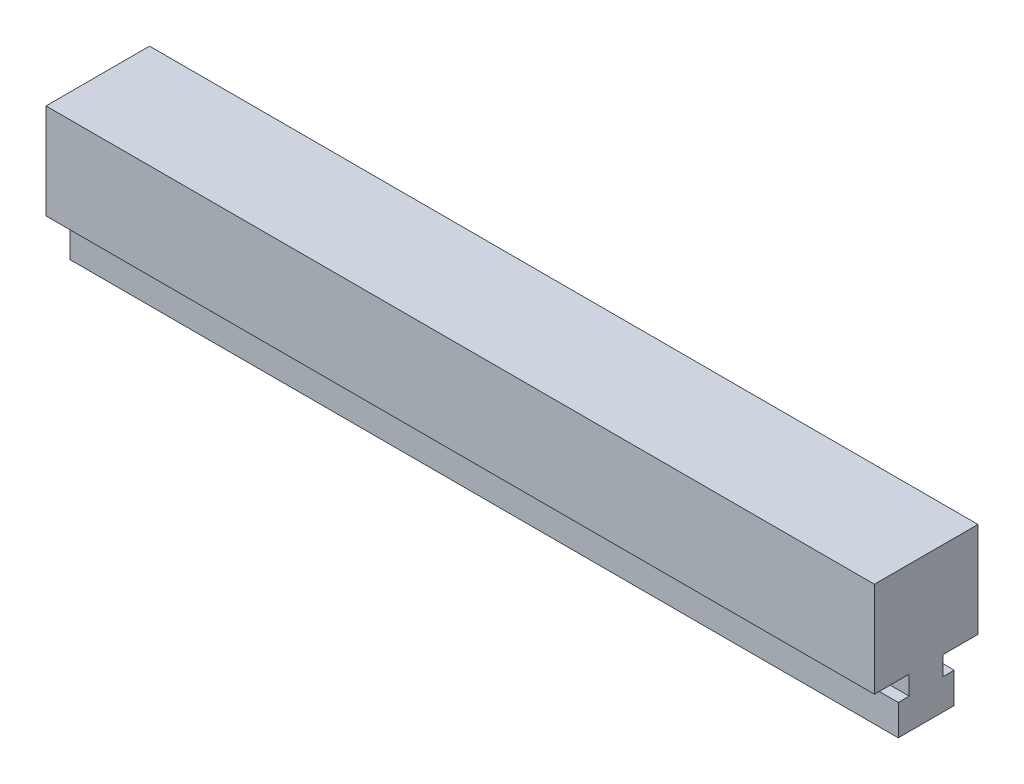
ISO-10303-21;
HEADER;
FILE_DESCRIPTION(('STEP AP214'),'2;1');
FILE_NAME('part.step','',(''),(''),'','','');
FILE_SCHEMA(('AUTOMOTIVE_DESIGN { 1 0 10303 214 1 1 1 1 }'));
ENDSEC;
DATA;
#1=APPLICATION_CONTEXT('core data for automotive mechanical design processes');
#2=APPLICATION_PROTOCOL_DEFINITION('international standard','automotive_design',2000,#1);
#3=PRODUCT_CONTEXT('',#1,'mechanical');
#4=PRODUCT('Part','Part','',(#3));
#5=PRODUCT_RELATED_PRODUCT_CATEGORY('part','',(#4));
#6=PRODUCT_DEFINITION_FORMATION('','',#4);
#7=PRODUCT_DEFINITION_CONTEXT('part definition',#1,'design');
#8=PRODUCT_DEFINITION('design','',#6,#7);
#9=PRODUCT_DEFINITION_SHAPE('','',#8);
#10=(LENGTH_UNIT() NAMED_UNIT(*) SI_UNIT(.MILLI.,.METRE.));
#11=(NAMED_UNIT(*) PLANE_ANGLE_UNIT() SI_UNIT($,.RADIAN.));
#12=(NAMED_UNIT(*) SI_UNIT($,.STERADIAN.) SOLID_ANGLE_UNIT());
#13=UNCERTAINTY_MEASURE_WITH_UNIT(LENGTH_MEASURE(1.E-05),#10,'distance_accuracy_value','');
#14=(GEOMETRIC_REPRESENTATION_CONTEXT(3) GLOBAL_UNCERTAINTY_ASSIGNED_CONTEXT((#13)) GLOBAL_UNIT_ASSIGNED_CONTEXT((#10,
#11,#12)) REPRESENTATION_CONTEXT('',''));
#15=CARTESIAN_POINT('',(0.,0.,0.));
#16=DIRECTION('',(0.,0.,1.));
#17=DIRECTION('',(1.,0.,0.));
#18=AXIS2_PLACEMENT_3D('',#15,#16,#17);
#19=CARTESIAN_POINT('',(200.,-5.69655035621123,-4.42759638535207));
#20=DIRECTION('',(0.,1.,0.));
#21=DIRECTION('',(0.,0.,1.));
#22=AXIS2_PLACEMENT_3D('',#19,#20,#21);
#23=PLANE('',#22);
#24=DIRECTION('',(0.,0.,-1.));
#25=VECTOR('',#24,1.);
#26=CARTESIAN_POINT('',(0.,-5.69655035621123,-4.42759638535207));
#27=LINE('',#26,#25);
#28=CARTESIAN_POINT('',(0.,-5.69655035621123,-4.42759638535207));
#29=VERTEX_POINT('',#28);
#30=CARTESIAN_POINT('',(0.,-5.69655035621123,-12.8275902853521));
#31=VERTEX_POINT('',#30);
#32=EDGE_CURVE('E211',#29,#31,#27,.T.);
#33=ORIENTED_EDGE('',*,*,#32,.T.);
#34=DIRECTION('',(-1.,0.,0.));
#35=VECTOR('',#34,1.);
#36=CARTESIAN_POINT('',(200.,-5.69655035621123,-12.8275902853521));
#37=LINE('',#36,#35);
#38=CARTESIAN_POINT('',(200.,-5.69655035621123,-12.8275902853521));
#39=VERTEX_POINT('',#38);
#40=EDGE_CURVE('E13',#39,#31,#37,.T.);
#41=ORIENTED_EDGE('',*,*,#40,.F.);
#42=DIRECTION('',(0.,0.,-1.));
#43=VECTOR('',#42,1.);
#44=CARTESIAN_POINT('',(200.,-5.69655035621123,-4.42759638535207));
#45=LINE('',#44,#43);
#46=CARTESIAN_POINT('',(200.,-5.69655035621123,-4.42759638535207));
#47=VERTEX_POINT('',#46);
#48=EDGE_CURVE('E245',#47,#39,#45,.T.);
#49=ORIENTED_EDGE('',*,*,#48,.F.);
#50=DIRECTION('',(-1.,0.,0.));
#51=VECTOR('',#50,1.);
#52=CARTESIAN_POINT('',(200.,-5.69655035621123,-4.42759638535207));
#53=LINE('',#52,#51);
#54=EDGE_CURVE('E207',#47,#29,#53,.T.);
#55=ORIENTED_EDGE('',*,*,#54,.T.);
#56=EDGE_LOOP('',(#33,#41,#49,#55));
#57=FACE_BOUND('',#56,.T.);
#58=ADVANCED_FACE('F86',(#57),#23,.F.);
#59=CARTESIAN_POINT('',(200.,-5.69655035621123,-12.8275902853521));
#60=DIRECTION('',(0.,0.,1.));
#61=DIRECTION('',(1.,0.,0.));
#62=AXIS2_PLACEMENT_3D('',#59,#60,#61);
#63=PLANE('',#62);
#64=DIRECTION('',(0.,1.,0.));
#65=VECTOR('',#64,1.);
#66=CARTESIAN_POINT('',(0.,-5.69655035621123,-12.8275902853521));
#67=LINE('',#66,#65);
#68=CARTESIAN_POINT('',(0.,17.3034420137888,-12.8275902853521));
#69=VERTEX_POINT('',#68);
#70=EDGE_CURVE('E215',#31,#69,#67,.T.);
#71=ORIENTED_EDGE('',*,*,#70,.T.);
#72=DIRECTION('',(-1.,0.,0.));
#73=VECTOR('',#72,1.);
#74=CARTESIAN_POINT('',(200.,17.3034420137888,-12.8275902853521));
#75=LINE('',#74,#73);
#76=CARTESIAN_POINT('',(200.,17.3034420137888,-12.8275902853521));
#77=VERTEX_POINT('',#76);
#78=EDGE_CURVE('E95',#77,#69,#75,.T.);
#79=ORIENTED_EDGE('',*,*,#78,.F.);
#80=DIRECTION('',(0.,1.,0.));
#81=VECTOR('',#80,1.);
#82=CARTESIAN_POINT('',(200.,-5.69655035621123,-12.8275902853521));
#83=LINE('',#82,#81);
#84=EDGE_CURVE('E158',#39,#77,#83,.T.);
#85=ORIENTED_EDGE('',*,*,#84,.F.);
#86=ORIENTED_EDGE('',*,*,#40,.T.);
#87=EDGE_LOOP('',(#71,#79,#85,#86));
#88=FACE_BOUND('',#87,.T.);
#89=ADVANCED_FACE('F339',(#88),#63,.F.);
#90=CARTESIAN_POINT('',(200.,17.3034420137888,-12.8275902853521));
#91=DIRECTION('',(0.,-1.,0.));
#92=DIRECTION('',(0.,0.,-1.));
#93=AXIS2_PLACEMENT_3D('',#90,#91,#92);
#94=PLANE('',#93);
#95=DIRECTION('',(0.,0.,1.));
#96=VECTOR('',#95,1.);
#97=CARTESIAN_POINT('',(0.,17.3034420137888,-12.8275902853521));
#98=LINE('',#97,#96);
#99=CARTESIAN_POINT('',(0.,17.3034420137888,12.1724097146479));
#100=VERTEX_POINT('',#99);
#101=EDGE_CURVE('E218',#69,#100,#98,.T.);
#102=ORIENTED_EDGE('',*,*,#101,.T.);
#103=DIRECTION('',(-1.,0.,0.));
#104=VECTOR('',#103,1.);
#105=CARTESIAN_POINT('',(200.,17.3034420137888,12.1724097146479));
#106=LINE('',#105,#104);
#107=CARTESIAN_POINT('',(200.,17.3034420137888,12.1724097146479));
#108=VERTEX_POINT('',#107);
#109=EDGE_CURVE('E272',#108,#100,#106,.T.);
#110=ORIENTED_EDGE('',*,*,#109,.F.);
#111=DIRECTION('',(0.,0.,1.));
#112=VECTOR('',#111,1.);
#113=CARTESIAN_POINT('',(200.,17.3034420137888,-12.8275902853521));
#114=LINE('',#113,#112);
#115=EDGE_CURVE('E282',#77,#108,#114,.T.);
#116=ORIENTED_EDGE('',*,*,#115,.F.);
#117=ORIENTED_EDGE('',*,*,#78,.T.);
#118=EDGE_LOOP('',(#102,#110,#116,#117));
#119=FACE_BOUND('',#118,.T.);
#120=ADVANCED_FACE('F280',(#119),#94,.F.);
#121=CARTESIAN_POINT('',(200.,17.3034420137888,12.1724097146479));
#122=DIRECTION('',(0.,0.,-1.));
#123=DIRECTION('',(-1.,0.,0.));
#124=AXIS2_PLACEMENT_3D('',#121,#122,#123);
#125=PLANE('',#124);
#126=DIRECTION('',(0.,-1.,0.));
#127=VECTOR('',#126,1.);
#128=CARTESIAN_POINT('',(0.,17.3034420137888,12.1724097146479));
#129=LINE('',#128,#127);
#130=CARTESIAN_POINT('',(0.,-5.69655035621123,12.1724097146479));
#131=VERTEX_POINT('',#130);
#132=EDGE_CURVE('E221',#100,#131,#129,.T.);
#133=ORIENTED_EDGE('',*,*,#132,.T.);
#134=DIRECTION('',(-1.,0.,0.));
#135=VECTOR('',#134,1.);
#136=CARTESIAN_POINT('',(200.,-5.69655035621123,12.1724097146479));
#137=LINE('',#136,#135);
#138=CARTESIAN_POINT('',(200.,-5.69655035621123,12.1724097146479));
#139=VERTEX_POINT('',#138);
#140=EDGE_CURVE('E268',#139,#131,#137,.T.);
#141=ORIENTED_EDGE('',*,*,#140,.F.);
#142=DIRECTION('',(0.,-1.,0.));
#143=VECTOR('',#142,1.);
#144=CARTESIAN_POINT('',(200.,17.3034420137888,12.1724097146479));
#145=LINE('',#144,#143);
#146=EDGE_CURVE('E301',#108,#139,#145,.T.);
#147=ORIENTED_EDGE('',*,*,#146,.F.);
#148=ORIENTED_EDGE('',*,*,#109,.T.);
#149=EDGE_LOOP('',(#133,#141,#147,#148));
#150=FACE_BOUND('',#149,.T.);
#151=ADVANCED_FACE('F291',(#150),#125,.F.);
#152=CARTESIAN_POINT('',(200.,-5.69655035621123,12.1724097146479));
#153=DIRECTION('',(0.,1.,0.));
#154=DIRECTION('',(0.,0.,1.));
#155=AXIS2_PLACEMENT_3D('',#152,#153,#154);
#156=PLANE('',#155);
#157=DIRECTION('',(0.,0.,-1.));
#158=VECTOR('',#157,1.);
#159=CARTESIAN_POINT('',(0.,-5.69655035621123,12.1724097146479));
#160=LINE('',#159,#158);
#161=CARTESIAN_POINT('',(0.,-5.69655035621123,3.77241581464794));
#162=VERTEX_POINT('',#161);
#163=EDGE_CURVE('E224',#131,#162,#160,.T.);
#164=ORIENTED_EDGE('',*,*,#163,.T.);
#165=DIRECTION('',(-1.,0.,0.));
#166=VECTOR('',#165,1.);
#167=CARTESIAN_POINT('',(200.,-5.69655035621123,3.77241581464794));
#168=LINE('',#167,#166);
#169=CARTESIAN_POINT('',(200.,-5.69655035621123,3.77241581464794));
#170=VERTEX_POINT('',#169);
#171=EDGE_CURVE('E264',#170,#162,#168,.T.);
#172=ORIENTED_EDGE('',*,*,#171,.F.);
#173=DIRECTION('',(0.,0.,-1.));
#174=VECTOR('',#173,1.);
#175=CARTESIAN_POINT('',(200.,-5.69655035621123,12.1724097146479));
#176=LINE('',#175,#174);
#177=EDGE_CURVE('E297',#139,#170,#176,.T.);
#178=ORIENTED_EDGE('',*,*,#177,.F.);
#179=ORIENTED_EDGE('',*,*,#140,.T.);
#180=EDGE_LOOP('',(#164,#172,#178,#179));
#181=FACE_BOUND('',#180,.T.);
#182=ADVANCED_FACE('F295',(#181),#156,.F.);
#183=CARTESIAN_POINT('',(200.,-5.69655035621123,3.77241581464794));
#184=DIRECTION('',(0.,0.,-1.));
#185=DIRECTION('',(-1.,0.,0.));
#186=AXIS2_PLACEMENT_3D('',#183,#184,#185);
#187=PLANE('',#186);
#188=DIRECTION('',(0.,-1.,0.));
#189=VECTOR('',#188,1.);
#190=CARTESIAN_POINT('',(0.,-5.69655035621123,3.77241581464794));
#191=LINE('',#190,#189);
#192=CARTESIAN_POINT('',(0.,-10.2965488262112,3.77241581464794));
#193=VERTEX_POINT('',#192);
#194=EDGE_CURVE('E227',#162,#193,#191,.T.);
#195=ORIENTED_EDGE('',*,*,#194,.T.);
#196=DIRECTION('',(-1.,0.,0.));
#197=VECTOR('',#196,1.);
#198=CARTESIAN_POINT('',(200.,-10.2965488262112,3.77241581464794));
#199=LINE('',#198,#197);
#200=CARTESIAN_POINT('',(200.,-10.2965488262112,3.77241581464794));
#201=VERTEX_POINT('',#200);
#202=EDGE_CURVE('E260',#201,#193,#199,.T.);
#203=ORIENTED_EDGE('',*,*,#202,.F.);
#204=DIRECTION('',(0.,-1.,0.));
#205=VECTOR('',#204,1.);
#206=CARTESIAN_POINT('',(200.,-5.69655035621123,3.77241581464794));
#207=LINE('',#206,#205);
#208=EDGE_CURVE('E300',#170,#201,#207,.T.);
#209=ORIENTED_EDGE('',*,*,#208,.F.);
#210=ORIENTED_EDGE('',*,*,#171,.T.);
#211=EDGE_LOOP('',(#195,#203,#209,#210));
#212=FACE_BOUND('',#211,.T.);
#213=ADVANCED_FACE('F352',(#212),#187,.F.);
#214=CARTESIAN_POINT('',(200.,-10.2965488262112,3.77241581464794));
#215=DIRECTION('',(0.,-1.,0.));
#216=DIRECTION('',(0.,0.,-1.));
#217=AXIS2_PLACEMENT_3D('',#214,#215,#216);
#218=PLANE('',#217);
#219=DIRECTION('',(0.,0.,1.));
#220=VECTOR('',#219,1.);
#221=CARTESIAN_POINT('',(0.,-10.2965488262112,3.77241581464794));
#222=LINE('',#221,#220);
#223=CARTESIAN_POINT('',(0.,-10.2965488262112,6.42240971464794));
#224=VERTEX_POINT('',#223);
#225=EDGE_CURVE('E230',#193,#224,#222,.T.);
#226=ORIENTED_EDGE('',*,*,#225,.T.);
#227=DIRECTION('',(-1.,0.,0.));
#228=VECTOR('',#227,1.);
#229=CARTESIAN_POINT('',(200.,-10.2965488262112,6.42240971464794));
#230=LINE('',#229,#228);
#231=CARTESIAN_POINT('',(200.,-10.2965488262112,6.42240971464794));
#232=VERTEX_POINT('',#231);
#233=EDGE_CURVE('E256',#232,#224,#230,.T.);
#234=ORIENTED_EDGE('',*,*,#233,.F.);
#235=DIRECTION('',(0.,0.,1.));
#236=VECTOR('',#235,1.);
#237=CARTESIAN_POINT('',(200.,-10.2965488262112,3.77241581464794));
#238=LINE('',#237,#236);
#239=EDGE_CURVE('E305',#201,#232,#238,.T.);
#240=ORIENTED_EDGE('',*,*,#239,.F.);
#241=ORIENTED_EDGE('',*,*,#202,.T.);
#242=EDGE_LOOP('',(#226,#234,#240,#241));
#243=FACE_BOUND('',#242,.T.);
#244=ADVANCED_FACE('F355',(#243),#218,.F.);
#245=CARTESIAN_POINT('',(200.,-10.2965488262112,6.42240971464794));
#246=DIRECTION('',(0.,0.,-1.));
#247=DIRECTION('',(-1.,0.,0.));
#248=AXIS2_PLACEMENT_3D('',#245,#246,#247);
#249=PLANE('',#248);
#250=DIRECTION('',(0.,-1.,0.));
#251=VECTOR('',#250,1.);
#252=CARTESIAN_POINT('',(0.,-10.2965488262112,6.42240971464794));
#253=LINE('',#252,#251);
#254=CARTESIAN_POINT('',(0.,-17.6965503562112,6.42240971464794));
#255=VERTEX_POINT('',#254);
#256=EDGE_CURVE('E233',#224,#255,#253,.T.);
#257=ORIENTED_EDGE('',*,*,#256,.T.);
#258=DIRECTION('',(-1.,0.,0.));
#259=VECTOR('',#258,1.);
#260=CARTESIAN_POINT('',(200.,-17.6965503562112,6.42240971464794));
#261=LINE('',#260,#259);
#262=CARTESIAN_POINT('',(200.,-17.6965503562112,6.42240971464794));
#263=VERTEX_POINT('',#262);
#264=EDGE_CURVE('E252',#263,#255,#261,.T.);
#265=ORIENTED_EDGE('',*,*,#264,.F.);
#266=DIRECTION('',(0.,-1.,0.));
#267=VECTOR('',#266,1.);
#268=CARTESIAN_POINT('',(200.,-10.2965488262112,6.42240971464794));
#269=LINE('',#268,#267);
#270=EDGE_CURVE('E312',#232,#263,#269,.T.);
#271=ORIENTED_EDGE('',*,*,#270,.F.);
#272=ORIENTED_EDGE('',*,*,#233,.T.);
#273=EDGE_LOOP('',(#257,#265,#271,#272));
#274=FACE_BOUND('',#273,.T.);
#275=ADVANCED_FACE('F320',(#274),#249,.F.);
#276=CARTESIAN_POINT('',(200.,-17.6965503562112,6.42240971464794));
#277=DIRECTION('',(0.,1.,0.));
#278=DIRECTION('',(0.,0.,1.));
#279=AXIS2_PLACEMENT_3D('',#276,#277,#278);
#280=PLANE('',#279);
#281=DIRECTION('',(0.,0.,-1.));
#282=VECTOR('',#281,1.);
#283=CARTESIAN_POINT('',(0.,-17.6965503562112,6.42240971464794));
#284=LINE('',#283,#282);
#285=CARTESIAN_POINT('',(0.,-17.6965503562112,-7.07759028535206));
#286=VERTEX_POINT('',#285);
#287=EDGE_CURVE('E236',#255,#286,#284,.T.);
#288=ORIENTED_EDGE('',*,*,#287,.T.);
#289=DIRECTION('',(-1.,0.,0.));
#290=VECTOR('',#289,1.);
#291=CARTESIAN_POINT('',(200.,-17.6965503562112,-7.07759028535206));
#292=LINE('',#291,#290);
#293=CARTESIAN_POINT('',(200.,-17.6965503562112,-7.07759028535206));
#294=VERTEX_POINT('',#293);
#295=EDGE_CURVE('E200',#294,#286,#292,.T.);
#296=ORIENTED_EDGE('',*,*,#295,.F.);
#297=DIRECTION('',(0.,0.,-1.));
#298=VECTOR('',#297,1.);
#299=CARTESIAN_POINT('',(200.,-17.6965503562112,6.42240971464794));
#300=LINE('',#299,#298);
#301=EDGE_CURVE('E189',#263,#294,#300,.T.);
#302=ORIENTED_EDGE('',*,*,#301,.F.);
#303=ORIENTED_EDGE('',*,*,#264,.T.);
#304=EDGE_LOOP('',(#288,#296,#302,#303));
#305=FACE_BOUND('',#304,.T.);
#306=ADVANCED_FACE('F324',(#305),#280,.F.);
#307=CARTESIAN_POINT('',(200.,-17.6965503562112,-7.07759028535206));
#308=DIRECTION('',(0.,0.,1.));
#309=DIRECTION('',(1.,0.,0.));
#310=AXIS2_PLACEMENT_3D('',#307,#308,#309);
#311=PLANE('',#310);
#312=DIRECTION('',(0.,1.,0.));
#313=VECTOR('',#312,1.);
#314=CARTESIAN_POINT('',(0.,-17.6965503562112,-7.07759028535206));
#315=LINE('',#314,#313);
#316=CARTESIAN_POINT('',(0.,-10.2965488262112,-7.07759028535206));
#317=VERTEX_POINT('',#316);
#318=EDGE_CURVE('E198',#286,#317,#315,.T.);
#319=ORIENTED_EDGE('',*,*,#318,.T.);
#320=DIRECTION('',(-1.,0.,0.));
#321=VECTOR('',#320,1.);
#322=CARTESIAN_POINT('',(200.,-10.2965488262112,-7.07759028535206));
#323=LINE('',#322,#321);
#324=CARTESIAN_POINT('',(200.,-10.2965488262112,-7.07759028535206));
#325=VERTEX_POINT('',#324);
#326=EDGE_CURVE('E195',#325,#317,#323,.T.);
#327=ORIENTED_EDGE('',*,*,#326,.F.);
#328=DIRECTION('',(0.,1.,0.));
#329=VECTOR('',#328,1.);
#330=CARTESIAN_POINT('',(200.,-17.6965503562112,-7.07759028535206));
#331=LINE('',#330,#329);
#332=EDGE_CURVE('E183',#294,#325,#331,.T.);
#333=ORIENTED_EDGE('',*,*,#332,.F.);
#334=ORIENTED_EDGE('',*,*,#295,.T.);
#335=EDGE_LOOP('',(#319,#327,#333,#334));
#336=FACE_BOUND('',#335,.T.);
#337=ADVANCED_FACE('F196',(#336),#311,.F.);
#338=CARTESIAN_POINT('',(200.,-10.2965488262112,-7.07759028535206));
#339=DIRECTION('',(0.,-1.,0.));
#340=DIRECTION('',(0.,0.,-1.));
#341=AXIS2_PLACEMENT_3D('',#338,#339,#340);
#342=PLANE('',#341);
#343=DIRECTION('',(0.,0.,1.));
#344=VECTOR('',#343,1.);
#345=CARTESIAN_POINT('',(0.,-10.2965488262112,-7.07759028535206));
#346=LINE('',#345,#344);
#347=CARTESIAN_POINT('',(0.,-10.2965488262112,-4.42759638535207));
#348=VERTEX_POINT('',#347);
#349=EDGE_CURVE('E144',#317,#348,#346,.T.);
#350=ORIENTED_EDGE('',*,*,#349,.T.);
#351=DIRECTION('',(-1.,0.,0.));
#352=VECTOR('',#351,1.);
#353=CARTESIAN_POINT('',(200.,-10.2965488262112,-4.42759638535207));
#354=LINE('',#353,#352);
#355=CARTESIAN_POINT('',(200.,-10.2965488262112,-4.42759638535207));
#356=VERTEX_POINT('',#355);
#357=EDGE_CURVE('E201',#356,#348,#354,.T.);
#358=ORIENTED_EDGE('',*,*,#357,.F.);
#359=DIRECTION('',(0.,0.,1.));
#360=VECTOR('',#359,1.);
#361=CARTESIAN_POINT('',(200.,-10.2965488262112,-7.07759028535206));
#362=LINE('',#361,#360);
#363=EDGE_CURVE('E187',#325,#356,#362,.T.);
#364=ORIENTED_EDGE('',*,*,#363,.F.);
#365=ORIENTED_EDGE('',*,*,#326,.T.);
#366=EDGE_LOOP('',(#350,#358,#364,#365));
#367=FACE_BOUND('',#366,.T.);
#368=ADVANCED_FACE('F203',(#367),#342,.F.);
#369=CARTESIAN_POINT('',(200.,-10.2965488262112,-4.42759638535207));
#370=DIRECTION('',(0.,0.,1.));
#371=DIRECTION('',(1.,0.,0.));
#372=AXIS2_PLACEMENT_3D('',#369,#370,#371);
#373=PLANE('',#372);
#374=DIRECTION('',(0.,1.,0.));
#375=VECTOR('',#374,1.);
#376=CARTESIAN_POINT('',(0.,-10.2965488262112,-4.42759638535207));
#377=LINE('',#376,#375);
#378=EDGE_CURVE('E150',#348,#29,#377,.T.);
#379=ORIENTED_EDGE('',*,*,#378,.T.);
#380=ORIENTED_EDGE('',*,*,#54,.F.);
#381=DIRECTION('',(0.,1.,0.));
#382=VECTOR('',#381,1.);
#383=CARTESIAN_POINT('',(200.,-10.2965488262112,-4.42759638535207));
#384=LINE('',#383,#382);
#385=EDGE_CURVE('E103',#356,#47,#384,.T.);
#386=ORIENTED_EDGE('',*,*,#385,.F.);
#387=ORIENTED_EDGE('',*,*,#357,.T.);
#388=EDGE_LOOP('',(#379,#380,#386,#387));
#389=FACE_BOUND('',#388,.T.);
#390=ADVANCED_FACE('F328',(#389),#373,.F.);
#391=CARTESIAN_POINT('',(200.,0.,0.));
#392=DIRECTION('',(1.,0.,0.));
#393=DIRECTION('',(0.,0.,-1.));
#394=AXIS2_PLACEMENT_3D('',#391,#392,#393);
#395=PLANE('',#394);
#396=ORIENTED_EDGE('',*,*,#48,.T.);
#397=ORIENTED_EDGE('',*,*,#84,.T.);
#398=ORIENTED_EDGE('',*,*,#115,.T.);
#399=ORIENTED_EDGE('',*,*,#146,.T.);
#400=ORIENTED_EDGE('',*,*,#177,.T.);
#401=ORIENTED_EDGE('',*,*,#208,.T.);
#402=ORIENTED_EDGE('',*,*,#239,.T.);
#403=ORIENTED_EDGE('',*,*,#270,.T.);
#404=ORIENTED_EDGE('',*,*,#301,.T.);
#405=ORIENTED_EDGE('',*,*,#332,.T.);
#406=ORIENTED_EDGE('',*,*,#363,.T.);
#407=ORIENTED_EDGE('',*,*,#385,.T.);
#408=EDGE_LOOP('',(#396,#397,#398,#399,#400,#401,#402,#403,#404,#405,#406,#407));
#409=FACE_BOUND('',#408,.T.);
#410=ADVANCED_FACE('F185',(#409),#395,.T.);
#411=CARTESIAN_POINT('',(0.,0.,0.));
#412=DIRECTION('',(1.,0.,0.));
#413=DIRECTION('',(0.,0.,-1.));
#414=AXIS2_PLACEMENT_3D('',#411,#412,#413);
#415=PLANE('',#414);
#416=ORIENTED_EDGE('',*,*,#32,.F.);
#417=ORIENTED_EDGE('',*,*,#378,.F.);
#418=ORIENTED_EDGE('',*,*,#349,.F.);
#419=ORIENTED_EDGE('',*,*,#318,.F.);
#420=ORIENTED_EDGE('',*,*,#287,.F.);
#421=ORIENTED_EDGE('',*,*,#256,.F.);
#422=ORIENTED_EDGE('',*,*,#225,.F.);
#423=ORIENTED_EDGE('',*,*,#194,.F.);
#424=ORIENTED_EDGE('',*,*,#163,.F.);
#425=ORIENTED_EDGE('',*,*,#132,.F.);
#426=ORIENTED_EDGE('',*,*,#101,.F.);
#427=ORIENTED_EDGE('',*,*,#70,.F.);
#428=EDGE_LOOP('',(#416,#417,#418,#419,#420,#421,#422,#423,#424,#425,#426,#427));
#429=FACE_BOUND('',#428,.T.);
#430=ADVANCED_FACE('F286',(#429),#415,.F.);
#431=CLOSED_SHELL('',(#58,#89,#120,#151,#182,#213,#244,#275,#306,#337,#368,#390,#410,#430));
#432=MANIFOLD_SOLID_BREP('B2',#431);
#433=ADVANCED_BREP_SHAPE_REPRESENTATION('',(#18,#432),#14);
#434=SHAPE_DEFINITION_REPRESENTATION(#9,#433);
ENDSEC;
END-ISO-10303-21;
